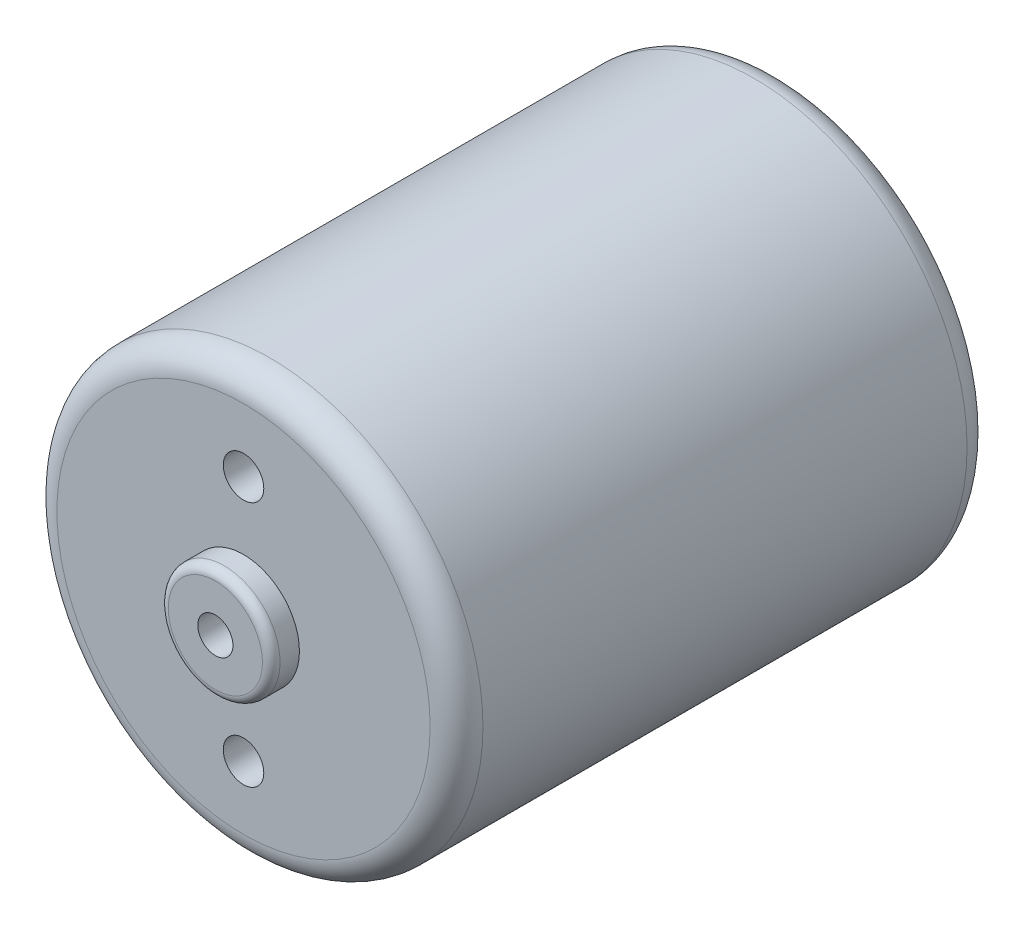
ISO-10303-21;
HEADER;
FILE_DESCRIPTION(('STEP AP214'),'2;1');
FILE_NAME('part.step','',(''),(''),'','','');
FILE_SCHEMA(('AUTOMOTIVE_DESIGN { 1 0 10303 214 1 1 1 1 }'));
ENDSEC;
DATA;
#1=APPLICATION_CONTEXT('core data for automotive mechanical design processes');
#2=APPLICATION_PROTOCOL_DEFINITION('international standard','automotive_design',2000,#1);
#3=PRODUCT_CONTEXT('',#1,'mechanical');
#4=PRODUCT('Part','Part','',(#3));
#5=PRODUCT_RELATED_PRODUCT_CATEGORY('part','',(#4));
#6=PRODUCT_DEFINITION_FORMATION('','',#4);
#7=PRODUCT_DEFINITION_CONTEXT('part definition',#1,'design');
#8=PRODUCT_DEFINITION('design','',#6,#7);
#9=PRODUCT_DEFINITION_SHAPE('','',#8);
#10=(LENGTH_UNIT() NAMED_UNIT(*) SI_UNIT(.MILLI.,.METRE.));
#11=(NAMED_UNIT(*) PLANE_ANGLE_UNIT() SI_UNIT($,.RADIAN.));
#12=(NAMED_UNIT(*) SI_UNIT($,.STERADIAN.) SOLID_ANGLE_UNIT());
#13=UNCERTAINTY_MEASURE_WITH_UNIT(LENGTH_MEASURE(1.E-05),#10,'distance_accuracy_value','');
#14=(GEOMETRIC_REPRESENTATION_CONTEXT(3) GLOBAL_UNCERTAINTY_ASSIGNED_CONTEXT((#13)) GLOBAL_UNIT_ASSIGNED_CONTEXT((#10,
#11,#12)) REPRESENTATION_CONTEXT('',''));
#15=CARTESIAN_POINT('',(0.,0.,0.));
#16=DIRECTION('',(0.,0.,1.));
#17=DIRECTION('',(1.,0.,0.));
#18=AXIS2_PLACEMENT_3D('',#15,#16,#17);
#19=CARTESIAN_POINT('',(0.,0.,-15.25));
#20=DIRECTION('',(0.,0.,1.));
#21=DIRECTION('',(1.,0.,0.));
#22=AXIS2_PLACEMENT_3D('',#19,#20,#21);
#23=PLANE('',#22);
#24=CARTESIAN_POINT('',(6.45,0.,-15.25));
#25=DIRECTION('',(0.,0.,-1.));
#26=DIRECTION('',(-1.,0.,0.));
#27=AXIS2_PLACEMENT_3D('',#24,#25,#26);
#28=CIRCLE('',#27,1.);
#29=CARTESIAN_POINT('',(5.45,0.,-15.25));
#30=VERTEX_POINT('',#29);
#31=EDGE_CURVE('E403',#30,#30,#28,.T.);
#32=ORIENTED_EDGE('',*,*,#31,.F.);
#33=EDGE_LOOP('',(#32));
#34=FACE_BOUND('',#33,.T.);
#35=CARTESIAN_POINT('',(-6.45,0.,-15.25));
#36=DIRECTION('',(0.,0.,-1.));
#37=DIRECTION('',(-1.,0.,0.));
#38=AXIS2_PLACEMENT_3D('',#35,#36,#37);
#39=CIRCLE('',#38,1.);
#40=CARTESIAN_POINT('',(-7.45,0.,-15.25));
#41=VERTEX_POINT('',#40);
#42=EDGE_CURVE('E410',#41,#41,#39,.T.);
#43=ORIENTED_EDGE('',*,*,#42,.F.);
#44=EDGE_LOOP('',(#43));
#45=FACE_BOUND('',#44,.T.);
#46=CARTESIAN_POINT('',(0.,0.,-15.25));
#47=DIRECTION('',(0.,0.,1.));
#48=DIRECTION('',(1.,0.,0.));
#49=AXIS2_PLACEMENT_3D('',#46,#47,#48);
#50=CIRCLE('',#49,10.6);
#51=CARTESIAN_POINT('',(10.6,0.,-15.25));
#52=VERTEX_POINT('',#51);
#53=EDGE_CURVE('E108',#52,#52,#50,.F.);
#54=ORIENTED_EDGE('',*,*,#53,.T.);
#55=EDGE_LOOP('',(#54));
#56=FACE_BOUND('',#55,.T.);
#57=CARTESIAN_POINT('',(0.,0.,-15.25));
#58=DIRECTION('',(0.,0.,-1.));
#59=DIRECTION('',(-1.,0.,0.));
#60=AXIS2_PLACEMENT_3D('',#57,#58,#59);
#61=CIRCLE('',#60,4.25);
#62=CARTESIAN_POINT('',(-3.75,2.,-15.25));
#63=VERTEX_POINT('',#62);
#64=CARTESIAN_POINT('',(-3.75,-2.,-15.25));
#65=VERTEX_POINT('',#64);
#66=EDGE_CURVE('E77',#63,#65,#61,.T.);
#67=ORIENTED_EDGE('',*,*,#66,.F.);
#68=DIRECTION('',(0.,1.,0.));
#69=VECTOR('',#68,1.);
#70=CARTESIAN_POINT('',(-3.75,2.,-15.25));
#71=LINE('',#70,#69);
#72=EDGE_CURVE('E82',#65,#63,#71,.T.);
#73=ORIENTED_EDGE('',*,*,#72,.F.);
#74=EDGE_LOOP('',(#67,#73));
#75=FACE_BOUND('',#74,.T.);
#76=ADVANCED_FACE('F43',(#34,#45,#56,#75),#23,.F.);
#77=CARTESIAN_POINT('',(0.,0.,15.25));
#78=DIRECTION('',(0.,0.,-1.));
#79=DIRECTION('',(-1.,0.,0.));
#80=AXIS2_PLACEMENT_3D('',#77,#78,#79);
#81=CYLINDRICAL_SURFACE('',#80,12.1);
#82=CARTESIAN_POINT('',(0.,0.,-13.75));
#83=DIRECTION('',(0.,0.,1.));
#84=DIRECTION('',(1.,0.,0.));
#85=AXIS2_PLACEMENT_3D('',#82,#83,#84);
#86=CIRCLE('',#85,12.1);
#87=CARTESIAN_POINT('',(-12.1,0.,-13.75));
#88=VERTEX_POINT('',#87);
#89=EDGE_CURVE('E104',#88,#88,#86,.T.);
#90=CARTESIAN_POINT('',(0.,0.,13.75));
#91=DIRECTION('',(0.,0.,1.));
#92=DIRECTION('',(1.,0.,0.));
#93=AXIS2_PLACEMENT_3D('',#90,#91,#92);
#94=CIRCLE('',#93,12.1);
#95=CARTESIAN_POINT('',(-12.1,0.,13.75));
#96=VERTEX_POINT('',#95);
#97=EDGE_CURVE('E100',#96,#96,#94,.F.);
#98=CARTESIAN_POINT('',(-12.1,0.,-13.75));
#99=CARTESIAN_POINT('',(-12.1,0.,-13.4635416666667));
#100=CARTESIAN_POINT('',(-12.1,0.,-13.1770833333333));
#101=CARTESIAN_POINT('',(-12.1,0.,-12.6041666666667));
#102=CARTESIAN_POINT('',(-12.1,0.,-12.3177083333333));
#103=CARTESIAN_POINT('',(-12.1,0.,-11.7447916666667));
#104=CARTESIAN_POINT('',(-12.1,0.,-11.4583333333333));
#105=CARTESIAN_POINT('',(-12.1,0.,-10.8854166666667));
#106=CARTESIAN_POINT('',(-12.1,0.,-10.5989583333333));
#107=CARTESIAN_POINT('',(-12.1,0.,-10.0260416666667));
#108=CARTESIAN_POINT('',(-12.1,0.,-9.73958333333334));
#109=CARTESIAN_POINT('',(-12.1,0.,-9.16666666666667));
#110=CARTESIAN_POINT('',(-12.1,0.,-8.88020833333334));
#111=CARTESIAN_POINT('',(-12.1,0.,-8.30729166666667));
#112=CARTESIAN_POINT('',(-12.1,0.,-8.02083333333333));
#113=CARTESIAN_POINT('',(-12.1,0.,-7.44791666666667));
#114=CARTESIAN_POINT('',(-12.1,0.,-7.16145833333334));
#115=CARTESIAN_POINT('',(-12.1,0.,-6.58854166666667));
#116=CARTESIAN_POINT('',(-12.1,0.,-6.30208333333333));
#117=CARTESIAN_POINT('',(-12.1,0.,-5.72916666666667));
#118=CARTESIAN_POINT('',(-12.1,0.,-5.44270833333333));
#119=CARTESIAN_POINT('',(-12.1,0.,-4.86979166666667));
#120=CARTESIAN_POINT('',(-12.1,0.,-4.58333333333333));
#121=CARTESIAN_POINT('',(-12.1,0.,-4.01041666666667));
#122=CARTESIAN_POINT('',(-12.1,0.,-3.72395833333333));
#123=CARTESIAN_POINT('',(-12.1,0.,-3.15104166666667));
#124=CARTESIAN_POINT('',(-12.1,0.,-2.86458333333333));
#125=CARTESIAN_POINT('',(-12.1,0.,-2.29166666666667));
#126=CARTESIAN_POINT('',(-12.1,0.,-2.00520833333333));
#127=CARTESIAN_POINT('',(-12.1,0.,-1.43229166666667));
#128=CARTESIAN_POINT('',(-12.1,0.,-1.14583333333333));
#129=CARTESIAN_POINT('',(-12.1,0.,-0.572916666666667));
#130=CARTESIAN_POINT('',(-12.1,0.,-0.286458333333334));
#131=CARTESIAN_POINT('',(-12.1,0.,0.286458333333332));
#132=CARTESIAN_POINT('',(-12.1,0.,0.572916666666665));
#133=CARTESIAN_POINT('',(-12.1,0.,1.14583333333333));
#134=CARTESIAN_POINT('',(-12.1,0.,1.43229166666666));
#135=CARTESIAN_POINT('',(-12.1,0.,2.00520833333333));
#136=CARTESIAN_POINT('',(-12.1,0.,2.29166666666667));
#137=CARTESIAN_POINT('',(-12.1,0.,2.86458333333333));
#138=CARTESIAN_POINT('',(-12.1,0.,3.15104166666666));
#139=CARTESIAN_POINT('',(-12.1,0.,3.72395833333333));
#140=CARTESIAN_POINT('',(-12.1,0.,4.01041666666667));
#141=CARTESIAN_POINT('',(-12.1,0.,4.58333333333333));
#142=CARTESIAN_POINT('',(-12.1,0.,4.86979166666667));
#143=CARTESIAN_POINT('',(-12.1,0.,5.44270833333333));
#144=CARTESIAN_POINT('',(-12.1,0.,5.72916666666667));
#145=CARTESIAN_POINT('',(-12.1,0.,6.30208333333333));
#146=CARTESIAN_POINT('',(-12.1,0.,6.58854166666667));
#147=CARTESIAN_POINT('',(-12.1,0.,7.16145833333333));
#148=CARTESIAN_POINT('',(-12.1,0.,7.44791666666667));
#149=CARTESIAN_POINT('',(-12.1,0.,8.02083333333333));
#150=CARTESIAN_POINT('',(-12.1,0.,8.30729166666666));
#151=CARTESIAN_POINT('',(-12.1,0.,8.88020833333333));
#152=CARTESIAN_POINT('',(-12.1,0.,9.16666666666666));
#153=CARTESIAN_POINT('',(-12.1,0.,9.73958333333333));
#154=CARTESIAN_POINT('',(-12.1,0.,10.0260416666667));
#155=CARTESIAN_POINT('',(-12.1,0.,10.5989583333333));
#156=CARTESIAN_POINT('',(-12.1,0.,10.8854166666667));
#157=CARTESIAN_POINT('',(-12.1,0.,11.4583333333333));
#158=CARTESIAN_POINT('',(-12.1,0.,11.7447916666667));
#159=CARTESIAN_POINT('',(-12.1,0.,12.3177083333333));
#160=CARTESIAN_POINT('',(-12.1,0.,12.6041666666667));
#161=CARTESIAN_POINT('',(-12.1,0.,13.1770833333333));
#162=CARTESIAN_POINT('',(-12.1,0.,13.4635416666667));
#163=CARTESIAN_POINT('',(-12.1,0.,13.75));
#164=B_SPLINE_CURVE_WITH_KNOTS('',3,(#98,#99,#100,#101,#102,#103,#104,#105,#106,#107,#108,#109,
#110,#111,#112,#113,#114,#115,#116,#117,#118,#119,#120,#121,#122,#123,#124,#125,#126,#127,#128,
#129,#130,#131,#132,#133,#134,#135,#136,#137,#138,#139,#140,#141,#142,#143,#144,#145,#146,#147,
#148,#149,#150,#151,#152,#153,#154,#155,#156,#157,#158,#159,#160,#161,#162,#163),.UNSPECIFIED.,
.F.,.F.,(4,2,2,2,2,2,2,2,2,2,2,2,2,2,2,2,2,2,2,2,2,2,2,2,2,2,2,2,2,2,2,2,4),(0.,
0.859374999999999,1.71875,2.578125,3.4375,4.296875,5.15625,6.015625,6.875,7.734375,8.59375,
9.453125,10.3125,11.171875,12.03125,12.890625,13.75,14.609375,15.46875,16.328125,17.1875,
18.046875,18.90625,19.765625,20.625,21.484375,22.34375,23.203125,24.0625,24.921875,25.78125,
26.640625,27.5),.UNSPECIFIED.);
#165=EDGE_CURVE('BSEAM158',#88,#96,#164,.T.);
#166=ORIENTED_EDGE('',*,*,#89,.T.);
#167=ORIENTED_EDGE('',*,*,#97,.T.);
#168=ORIENTED_EDGE('',*,*,#165,.T.);
#169=ORIENTED_EDGE('',*,*,#165,.F.);
#170=EDGE_LOOP('',(#166,#168,#167,#169));
#171=FACE_BOUND('',#170,.T.);
#172=ADVANCED_FACE('F158',(#171),#81,.T.);
#173=CARTESIAN_POINT('',(0.,0.,15.25));
#174=DIRECTION('',(0.,0.,1.));
#175=DIRECTION('',(1.,0.,0.));
#176=AXIS2_PLACEMENT_3D('',#173,#174,#175);
#177=PLANE('',#176);
#178=CARTESIAN_POINT('',(0.,7.,15.25));
#179=DIRECTION('',(0.,0.,1.));
#180=DIRECTION('',(1.,0.,0.));
#181=AXIS2_PLACEMENT_3D('',#178,#179,#180);
#182=CIRCLE('',#181,1.15);
#183=CARTESIAN_POINT('',(1.15,7.,15.25));
#184=VERTEX_POINT('',#183);
#185=EDGE_CURVE('E426',#184,#184,#182,.T.);
#186=ORIENTED_EDGE('',*,*,#185,.F.);
#187=EDGE_LOOP('',(#186));
#188=FACE_BOUND('',#187,.T.);
#189=CARTESIAN_POINT('',(0.,-7.,15.25));
#190=DIRECTION('',(0.,0.,1.));
#191=DIRECTION('',(1.,0.,0.));
#192=AXIS2_PLACEMENT_3D('',#189,#190,#191);
#193=CIRCLE('',#192,1.15);
#194=CARTESIAN_POINT('',(1.15,-7.,15.25));
#195=VERTEX_POINT('',#194);
#196=EDGE_CURVE('E422',#195,#195,#193,.T.);
#197=ORIENTED_EDGE('',*,*,#196,.F.);
#198=EDGE_LOOP('',(#197));
#199=FACE_BOUND('',#198,.T.);
#200=CARTESIAN_POINT('',(0.,0.,15.25));
#201=DIRECTION('',(0.,0.,1.));
#202=DIRECTION('',(1.,0.,0.));
#203=AXIS2_PLACEMENT_3D('',#200,#201,#202);
#204=CIRCLE('',#203,3.175);
#205=CARTESIAN_POINT('',(3.175,0.,15.25));
#206=VERTEX_POINT('',#205);
#207=EDGE_CURVE('E96',#206,#206,#204,.T.);
#208=ORIENTED_EDGE('',*,*,#207,.F.);
#209=EDGE_LOOP('',(#208));
#210=FACE_BOUND('',#209,.T.);
#211=CARTESIAN_POINT('',(0.,0.,15.25));
#212=DIRECTION('',(0.,0.,1.));
#213=DIRECTION('',(1.,0.,0.));
#214=AXIS2_PLACEMENT_3D('',#211,#212,#213);
#215=CIRCLE('',#214,10.6);
#216=CARTESIAN_POINT('',(10.6,0.,15.25));
#217=VERTEX_POINT('',#216);
#218=EDGE_CURVE('E112',#217,#217,#215,.T.);
#219=ORIENTED_EDGE('',*,*,#218,.T.);
#220=EDGE_LOOP('',(#219));
#221=FACE_BOUND('',#220,.T.);
#222=ADVANCED_FACE('F154',(#188,#199,#210,#221),#177,.T.);
#223=CARTESIAN_POINT('',(0.,0.,-13.75));
#224=DIRECTION('',(0.,0.,1.));
#225=DIRECTION('',(1.,0.,0.));
#226=AXIS2_PLACEMENT_3D('',#223,#224,#225);
#227=TOROIDAL_SURFACE('',#226,10.6,1.5);
#228=ORIENTED_EDGE('',*,*,#53,.F.);
#229=EDGE_LOOP('',(#228));
#230=FACE_BOUND('',#229,.T.);
#231=ORIENTED_EDGE('',*,*,#89,.F.);
#232=EDGE_LOOP('',(#231));
#233=FACE_BOUND('',#232,.T.);
#234=ADVANCED_FACE('F157',(#230,#233),#227,.T.);
#235=CARTESIAN_POINT('',(0.,0.,13.75));
#236=DIRECTION('',(0.,0.,1.));
#237=DIRECTION('',(1.,0.,0.));
#238=AXIS2_PLACEMENT_3D('',#235,#236,#237);
#239=TOROIDAL_SURFACE('',#238,10.6,1.5);
#240=ORIENTED_EDGE('',*,*,#97,.F.);
#241=EDGE_LOOP('',(#240));
#242=FACE_BOUND('',#241,.T.);
#243=ORIENTED_EDGE('',*,*,#218,.F.);
#244=EDGE_LOOP('',(#243));
#245=FACE_BOUND('',#244,.T.);
#246=ADVANCED_FACE('F152',(#242,#245),#239,.T.);
#247=CARTESIAN_POINT('',(0.,0.,16.85));
#248=DIRECTION('',(0.,0.,-1.));
#249=DIRECTION('',(-1.,0.,0.));
#250=AXIS2_PLACEMENT_3D('',#247,#248,#249);
#251=CYLINDRICAL_SURFACE('',#250,3.175);
#252=CARTESIAN_POINT('',(0.,0.,16.35));
#253=DIRECTION('',(0.,0.,1.));
#254=DIRECTION('',(1.,0.,0.));
#255=AXIS2_PLACEMENT_3D('',#252,#253,#254);
#256=CIRCLE('',#255,3.175);
#257=CARTESIAN_POINT('',(3.175,0.,16.35));
#258=VERTEX_POINT('',#257);
#259=EDGE_CURVE('E11',#258,#258,#256,.F.);
#260=ORIENTED_EDGE('',*,*,#259,.T.);
#261=EDGE_LOOP('',(#260));
#262=FACE_BOUND('',#261,.T.);
#263=ORIENTED_EDGE('',*,*,#207,.T.);
#264=EDGE_LOOP('',(#263));
#265=FACE_BOUND('',#264,.T.);
#266=ADVANCED_FACE('F148',(#262,#265),#251,.T.);
#267=CARTESIAN_POINT('',(0.,0.,16.85));
#268=DIRECTION('',(0.,0.,1.));
#269=DIRECTION('',(1.,0.,0.));
#270=AXIS2_PLACEMENT_3D('',#267,#268,#269);
#271=PLANE('',#270);
#272=CARTESIAN_POINT('',(0.,0.,16.85));
#273=DIRECTION('',(0.,0.,1.));
#274=DIRECTION('',(1.,0.,0.));
#275=AXIS2_PLACEMENT_3D('',#272,#273,#274);
#276=CIRCLE('',#275,2.675);
#277=CARTESIAN_POINT('',(2.675,0.,16.85));
#278=VERTEX_POINT('',#277);
#279=EDGE_CURVE('E52',#278,#278,#276,.T.);
#280=ORIENTED_EDGE('',*,*,#279,.T.);
#281=EDGE_LOOP('',(#280));
#282=FACE_BOUND('',#281,.T.);
#283=CARTESIAN_POINT('',(0.,0.,16.85));
#284=DIRECTION('',(0.,0.,1.));
#285=DIRECTION('',(1.,0.,0.));
#286=AXIS2_PLACEMENT_3D('',#283,#284,#285);
#287=CIRCLE('',#286,1.);
#288=CARTESIAN_POINT('',(1.,0.,16.85));
#289=VERTEX_POINT('',#288);
#290=EDGE_CURVE('E394',#289,#289,#287,.T.);
#291=ORIENTED_EDGE('',*,*,#290,.F.);
#292=EDGE_LOOP('',(#291));
#293=FACE_BOUND('',#292,.T.);
#294=ADVANCED_FACE('F145',(#282,#293),#271,.T.);
#295=CARTESIAN_POINT('',(0.,0.,-17.25));
#296=DIRECTION('',(0.,0.,1.));
#297=DIRECTION('',(1.,0.,0.));
#298=AXIS2_PLACEMENT_3D('',#295,#296,#297);
#299=CYLINDRICAL_SURFACE('',#298,4.25);
#300=DIRECTION('',(0.,0.,1.));
#301=VECTOR('',#300,1.);
#302=CARTESIAN_POINT('',(-3.75,-2.,-17.25));
#303=LINE('',#302,#301);
#304=CARTESIAN_POINT('',(-3.75,-2.,-16.75));
#305=VERTEX_POINT('',#304);
#306=EDGE_CURVE('E81',#305,#65,#303,.T.);
#307=ORIENTED_EDGE('',*,*,#306,.F.);
#308=CARTESIAN_POINT('',(0.,0.,-16.75));
#309=DIRECTION('',(0.,0.,-1.));
#310=DIRECTION('',(-1.,0.,0.));
#311=AXIS2_PLACEMENT_3D('',#308,#309,#310);
#312=CIRCLE('',#311,4.25);
#313=CARTESIAN_POINT('',(-3.75,2.,-16.75));
#314=VERTEX_POINT('',#313);
#315=EDGE_CURVE('E66',#305,#314,#312,.F.);
#316=ORIENTED_EDGE('',*,*,#315,.T.);
#317=DIRECTION('',(0.,0.,1.));
#318=VECTOR('',#317,1.);
#319=CARTESIAN_POINT('',(-3.75,2.,-17.25));
#320=LINE('',#319,#318);
#321=EDGE_CURVE('E74',#314,#63,#320,.T.);
#322=ORIENTED_EDGE('',*,*,#321,.T.);
#323=ORIENTED_EDGE('',*,*,#66,.T.);
#324=EDGE_LOOP('',(#307,#316,#322,#323));
#325=FACE_BOUND('',#324,.T.);
#326=ADVANCED_FACE('F76',(#325),#299,.T.);
#327=CARTESIAN_POINT('',(-3.75,2.,-17.25));
#328=DIRECTION('',(1.,0.,0.));
#329=DIRECTION('',(0.,0.,-1.));
#330=AXIS2_PLACEMENT_3D('',#327,#328,#329);
#331=PLANE('',#330);
#332=CARTESIAN_POINT('',(-3.75,2.,-16.75));
#333=CARTESIAN_POINT('',(-3.75,2.00003471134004,-16.7642078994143));
#334=CARTESIAN_POINT('',(-3.75,1.99871520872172,-16.7783774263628));
#335=CARTESIAN_POINT('',(-3.75,1.99367316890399,-16.8061557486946));
#336=CARTESIAN_POINT('',(-3.75,1.98997251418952,-16.819768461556));
#337=CARTESIAN_POINT('',(-3.75,1.9804782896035,-16.8461792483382));
#338=CARTESIAN_POINT('',(-3.75,1.97469112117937,-16.8589796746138));
#339=CARTESIAN_POINT('',(-3.75,1.9613984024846,-16.8836771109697));
#340=CARTESIAN_POINT('',(-3.75,1.95388868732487,-16.8955718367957));
#341=CARTESIAN_POINT('',(-3.75,1.93179249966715,-16.9263501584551));
#342=CARTESIAN_POINT('',(-3.75,1.91592632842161,-16.9443136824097));
#343=CARTESIAN_POINT('',(-3.75,1.88164328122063,-16.9775992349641));
#344=CARTESIAN_POINT('',(-3.75,1.86321950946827,-16.9929138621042));
#345=CARTESIAN_POINT('',(-3.75,1.8096498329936,-17.0323581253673));
#346=CARTESIAN_POINT('',(-3.75,1.77269791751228,-17.0540106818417));
#347=CARTESIAN_POINT('',(-3.75,1.69620167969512,-17.0919521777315));
#348=CARTESIAN_POINT('',(-3.75,1.65665140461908,-17.1082282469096));
#349=CARTESIAN_POINT('',(-3.75,1.55780019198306,-17.1432738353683));
#350=CARTESIAN_POINT('',(-3.75,1.49771601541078,-17.1597966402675));
#351=CARTESIAN_POINT('',(-3.75,1.37621733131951,-17.1870857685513));
#352=CARTESIAN_POINT('',(-3.75,1.31480002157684,-17.1978384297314));
#353=CARTESIAN_POINT('',(-3.75,1.19086880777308,-17.2153718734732));
#354=CARTESIAN_POINT('',(-3.75,1.12835000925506,-17.2221166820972));
#355=CARTESIAN_POINT('',(-3.75,1.0031513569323,-17.2327590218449));
#356=CARTESIAN_POINT('',(-3.75,0.9404717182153,-17.2366593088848));
#357=CARTESIAN_POINT('',(-3.75,0.803729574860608,-17.2431121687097));
#358=CARTESIAN_POINT('',(-3.75,0.729651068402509,-17.2452952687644));
#359=CARTESIAN_POINT('',(-3.75,0.581444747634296,-17.2482157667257));
#360=CARTESIAN_POINT('',(-3.75,0.507316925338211,-17.2489526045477));
#361=CARTESIAN_POINT('',(-3.75,0.36096870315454,-17.2497919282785));
#362=CARTESIAN_POINT('',(-3.75,0.288748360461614,-17.2499102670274));
#363=CARTESIAN_POINT('',(-3.75,0.180440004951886,-17.249986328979));
#364=CARTESIAN_POINT('',(-3.75,0.144351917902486,-17.2499947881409));
#365=CARTESIAN_POINT('',(-3.75,0.0721758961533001,-17.2500003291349));
#366=CARTESIAN_POINT('',(-3.75,0.0360879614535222,-17.2499974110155));
#367=CARTESIAN_POINT('',(-3.75,0.,-17.25));
#368=B_SPLINE_CURVE_WITH_KNOTS('',3,(#332,#333,#334,#335,#336,#337,#338,#339,#340,#341,#342,
#343,#344,#345,#346,#347,#348,#349,#350,#351,#352,#353,#354,#355,#356,#357,#358,#359,#360,#361,
#362,#363,#364,#365,#366,#367),.UNSPECIFIED.,.F.,.F.,(4,2,2,2,2,2,2,2,2,2,2,2,2,2,2,2,2,4),(0.,
0.0425015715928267,0.0846180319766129,0.126606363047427,0.168697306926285,0.240181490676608,
0.311862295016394,0.439621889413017,0.567685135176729,0.754138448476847,0.941031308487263,
1.12957730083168,1.31794037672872,1.5402440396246,1.76263377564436,1.97929442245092,
2.08755871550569,2.19582254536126),.UNSPECIFIED.);
#369=CARTESIAN_POINT('',(-3.75,0.,-17.25));
#370=VERTEX_POINT('',#369);
#371=EDGE_CURVE('E120',#314,#370,#368,.T.);
#372=ORIENTED_EDGE('',*,*,#371,.T.);
#373=CARTESIAN_POINT('',(-3.75,0.,-17.25));
#374=CARTESIAN_POINT('',(-3.75,-0.0416614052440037,-17.2499954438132));
#375=CARTESIAN_POINT('',(-3.75,-0.0833227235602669,-17.2500006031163));
#376=CARTESIAN_POINT('',(-3.75,-0.166645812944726,-17.2499907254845));
#377=CARTESIAN_POINT('',(-3.75,-0.20830758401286,-17.2499756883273));
#378=CARTESIAN_POINT('',(-3.75,-0.333377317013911,-17.2498407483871));
#379=CARTESIAN_POINT('',(-3.75,-0.416785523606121,-17.2496308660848));
#380=CARTESIAN_POINT('',(-3.75,-0.583564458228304,-17.2481609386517));
#381=CARTESIAN_POINT('',(-3.75,-0.666935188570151,-17.246901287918));
#382=CARTESIAN_POINT('',(-3.75,-0.83358395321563,-17.2419914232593));
#383=CARTESIAN_POINT('',(-3.75,-0.916862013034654,-17.238342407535));
#384=CARTESIAN_POINT('',(-3.75,-1.05690551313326,-17.228538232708));
#385=CARTESIAN_POINT('',(-3.75,-1.11374540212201,-17.2235371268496));
#386=CARTESIAN_POINT('',(-3.75,-1.2272418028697,-17.2106214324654));
#387=CARTESIAN_POINT('',(-3.75,-1.28389750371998,-17.202699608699));
#388=CARTESIAN_POINT('',(-3.75,-1.40569946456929,-17.1812084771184));
#389=CARTESIAN_POINT('',(-3.75,-1.47073476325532,-17.1669323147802));
#390=CARTESIAN_POINT('',(-3.75,-1.56644189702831,-17.1394673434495));
#391=CARTESIAN_POINT('',(-3.75,-1.59798295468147,-17.1293269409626));
#392=CARTESIAN_POINT('',(-3.75,-1.66013634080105,-17.1065428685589));
#393=CARTESIAN_POINT('',(-3.75,-1.690749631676,-17.093901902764));
#394=CARTESIAN_POINT('',(-3.75,-1.74245715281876,-17.0693141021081));
#395=CARTESIAN_POINT('',(-3.75,-1.76389553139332,-17.0580963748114));
#396=CARTESIAN_POINT('',(-3.75,-1.80565641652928,-17.0336498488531));
#397=CARTESIAN_POINT('',(-3.75,-1.82597730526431,-17.0204182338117));
#398=CARTESIAN_POINT('',(-3.75,-1.86508632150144,-16.9914500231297));
#399=CARTESIAN_POINT('',(-3.75,-1.88385764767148,-16.9756903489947));
#400=CARTESIAN_POINT('',(-3.75,-1.91866765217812,-16.9413757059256));
#401=CARTESIAN_POINT('',(-3.75,-1.93471342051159,-16.9228282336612));
#402=CARTESIAN_POINT('',(-3.75,-1.9573255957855,-16.8903414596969));
#403=CARTESIAN_POINT('',(-3.75,-1.96518392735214,-16.8773053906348));
#404=CARTESIAN_POINT('',(-3.75,-1.97878760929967,-16.8501954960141));
#405=CARTESIAN_POINT('',(-3.75,-1.98453918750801,-16.8361248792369));
#406=CARTESIAN_POINT('',(-3.75,-1.9925767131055,-16.8101064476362));
#407=CARTESIAN_POINT('',(-3.75,-1.9953276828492,-16.798302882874));
#408=CARTESIAN_POINT('',(-3.75,-1.99905488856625,-16.7743411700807));
#409=CARTESIAN_POINT('',(-3.75,-2.00001919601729,-16.762181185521));
#410=CARTESIAN_POINT('',(-3.75,-2.,-16.75));
#411=B_SPLINE_CURVE_WITH_KNOTS('',3,(#373,#374,#375,#376,#377,#378,#379,#380,#381,#382,#383,
#384,#385,#386,#387,#388,#389,#390,#391,#392,#393,#394,#395,#396,#397,#398,#399,#400,#401,#402,
#403,#404,#405,#406,#407,#408,#409,#410),.UNSPECIFIED.,.F.,.F.,(4,2,2,2,2,2,2,2,2,2,2,2,2,2,2,2,
2,2,4),(0.,0.124984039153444,0.249969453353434,0.500192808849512,0.750322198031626,
1.00032625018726,1.17144668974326,1.3429939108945,1.54232412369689,1.64164162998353,
1.74085231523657,1.813357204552,1.88596443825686,1.95927677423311,2.0323953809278,
2.0779141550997,2.1232972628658,2.15952677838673,2.19599731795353),.UNSPECIFIED.);
#412=EDGE_CURVE('E59',#370,#305,#411,.T.);
#413=ORIENTED_EDGE('',*,*,#412,.T.);
#414=ORIENTED_EDGE('',*,*,#306,.T.);
#415=ORIENTED_EDGE('',*,*,#72,.T.);
#416=ORIENTED_EDGE('',*,*,#321,.F.);
#417=EDGE_LOOP('',(#372,#413,#414,#415,#416));
#418=FACE_BOUND('',#417,.T.);
#419=ADVANCED_FACE('F89',(#418),#331,.F.);
#420=CARTESIAN_POINT('',(0.,0.,-17.25));
#421=DIRECTION('',(0.,0.,-1.));
#422=DIRECTION('',(-1.,0.,0.));
#423=AXIS2_PLACEMENT_3D('',#420,#421,#422);
#424=PLANE('',#423);
#425=CARTESIAN_POINT('',(0.,0.,-17.25));
#426=DIRECTION('',(0.,0.,-1.));
#427=DIRECTION('',(-1.,0.,0.));
#428=AXIS2_PLACEMENT_3D('',#425,#426,#427);
#429=CIRCLE('',#428,3.75);
#430=EDGE_CURVE('E116',#370,#370,#429,.T.);
#431=ORIENTED_EDGE('',*,*,#430,.T.);
#432=EDGE_LOOP('',(#431));
#433=FACE_BOUND('',#432,.T.);
#434=CARTESIAN_POINT('',(0.,0.,-17.25));
#435=DIRECTION('',(0.,0.,1.));
#436=DIRECTION('',(1.,0.,0.));
#437=AXIS2_PLACEMENT_3D('',#434,#435,#436);
#438=CIRCLE('',#437,1.);
#439=CARTESIAN_POINT('',(1.,0.,-17.25));
#440=VERTEX_POINT('',#439);
#441=EDGE_CURVE('E87',#440,#440,#438,.T.);
#442=ORIENTED_EDGE('',*,*,#441,.T.);
#443=EDGE_LOOP('',(#442));
#444=FACE_BOUND('',#443,.T.);
#445=ADVANCED_FACE('F140',(#433,#444),#424,.T.);
#446=CARTESIAN_POINT('',(0.,0.,-17.25));
#447=DIRECTION('',(0.,0.,1.));
#448=DIRECTION('',(1.,0.,0.));
#449=AXIS2_PLACEMENT_3D('',#446,#447,#448);
#450=CYLINDRICAL_SURFACE('',#449,1.);
#451=ORIENTED_EDGE('',*,*,#441,.F.);
#452=EDGE_LOOP('',(#451));
#453=FACE_BOUND('',#452,.T.);
#454=ORIENTED_EDGE('',*,*,#290,.T.);
#455=EDGE_LOOP('',(#454));
#456=FACE_BOUND('',#455,.T.);
#457=ADVANCED_FACE('F203',(#453,#456),#450,.F.);
#458=CARTESIAN_POINT('',(-6.45,0.,-5.25));
#459=DIRECTION('',(0.,0.,-1.));
#460=DIRECTION('',(-1.,0.,0.));
#461=AXIS2_PLACEMENT_3D('',#458,#459,#460);
#462=CYLINDRICAL_SURFACE('',#461,1.);
#463=CARTESIAN_POINT('',(-6.45,0.,-5.25));
#464=DIRECTION('',(0.,0.,-1.));
#465=DIRECTION('',(-1.,0.,0.));
#466=AXIS2_PLACEMENT_3D('',#463,#464,#465);
#467=CIRCLE('',#466,1.);
#468=CARTESIAN_POINT('',(-7.45,0.,-5.25));
#469=VERTEX_POINT('',#468);
#470=EDGE_CURVE('E406',#469,#469,#467,.T.);
#471=ORIENTED_EDGE('',*,*,#470,.F.);
#472=EDGE_LOOP('',(#471));
#473=FACE_BOUND('',#472,.T.);
#474=ORIENTED_EDGE('',*,*,#42,.T.);
#475=EDGE_LOOP('',(#474));
#476=FACE_BOUND('',#475,.T.);
#477=ADVANCED_FACE('F210',(#473,#476),#462,.F.);
#478=CARTESIAN_POINT('',(-6.45,0.,-5.25));
#479=DIRECTION('',(0.,0.,-1.));
#480=DIRECTION('',(-1.,0.,0.));
#481=AXIS2_PLACEMENT_3D('',#478,#479,#480);
#482=PLANE('',#481);
#483=ORIENTED_EDGE('',*,*,#470,.T.);
#484=EDGE_LOOP('',(#483));
#485=FACE_BOUND('',#484,.T.);
#486=ADVANCED_FACE('F218',(#485),#482,.T.);
#487=CARTESIAN_POINT('',(6.45,0.,-5.25));
#488=DIRECTION('',(0.,0.,-1.));
#489=DIRECTION('',(-1.,0.,0.));
#490=AXIS2_PLACEMENT_3D('',#487,#488,#489);
#491=CYLINDRICAL_SURFACE('',#490,1.);
#492=CARTESIAN_POINT('',(6.45,0.,-5.25));
#493=DIRECTION('',(0.,0.,-1.));
#494=DIRECTION('',(-1.,0.,0.));
#495=AXIS2_PLACEMENT_3D('',#492,#493,#494);
#496=CIRCLE('',#495,1.);
#497=CARTESIAN_POINT('',(5.45,0.,-5.25));
#498=VERTEX_POINT('',#497);
#499=EDGE_CURVE('E397',#498,#498,#496,.T.);
#500=ORIENTED_EDGE('',*,*,#499,.F.);
#501=EDGE_LOOP('',(#500));
#502=FACE_BOUND('',#501,.T.);
#503=ORIENTED_EDGE('',*,*,#31,.T.);
#504=EDGE_LOOP('',(#503));
#505=FACE_BOUND('',#504,.T.);
#506=ADVANCED_FACE('F226',(#502,#505),#491,.F.);
#507=CARTESIAN_POINT('',(6.45,0.,-5.25));
#508=DIRECTION('',(0.,0.,-1.));
#509=DIRECTION('',(-1.,0.,0.));
#510=AXIS2_PLACEMENT_3D('',#507,#508,#509);
#511=PLANE('',#510);
#512=ORIENTED_EDGE('',*,*,#499,.T.);
#513=EDGE_LOOP('',(#512));
#514=FACE_BOUND('',#513,.T.);
#515=ADVANCED_FACE('F234',(#514),#511,.T.);
#516=CARTESIAN_POINT('',(0.,-7.,10.25));
#517=DIRECTION('',(0.,0.,1.));
#518=DIRECTION('',(1.,0.,0.));
#519=AXIS2_PLACEMENT_3D('',#516,#517,#518);
#520=CYLINDRICAL_SURFACE('',#519,1.15);
#521=CARTESIAN_POINT('',(0.,-7.,10.25));
#522=DIRECTION('',(0.,0.,1.));
#523=DIRECTION('',(1.,0.,0.));
#524=AXIS2_PLACEMENT_3D('',#521,#522,#523);
#525=CIRCLE('',#524,1.15);
#526=CARTESIAN_POINT('',(1.15,-7.,10.25));
#527=VERTEX_POINT('',#526);
#528=EDGE_CURVE('E418',#527,#527,#525,.T.);
#529=ORIENTED_EDGE('',*,*,#528,.F.);
#530=EDGE_LOOP('',(#529));
#531=FACE_BOUND('',#530,.T.);
#532=ORIENTED_EDGE('',*,*,#196,.T.);
#533=EDGE_LOOP('',(#532));
#534=FACE_BOUND('',#533,.T.);
#535=ADVANCED_FACE('F242',(#531,#534),#520,.F.);
#536=CARTESIAN_POINT('',(0.,-7.,10.25));
#537=DIRECTION('',(0.,0.,1.));
#538=DIRECTION('',(1.,0.,0.));
#539=AXIS2_PLACEMENT_3D('',#536,#537,#538);
#540=PLANE('',#539);
#541=ORIENTED_EDGE('',*,*,#528,.T.);
#542=EDGE_LOOP('',(#541));
#543=FACE_BOUND('',#542,.T.);
#544=ADVANCED_FACE('F251',(#543),#540,.T.);
#545=CARTESIAN_POINT('',(0.,7.,10.25));
#546=DIRECTION('',(0.,0.,1.));
#547=DIRECTION('',(1.,0.,0.));
#548=AXIS2_PLACEMENT_3D('',#545,#546,#547);
#549=CYLINDRICAL_SURFACE('',#548,1.15);
#550=CARTESIAN_POINT('',(0.,7.,10.25));
#551=DIRECTION('',(0.,0.,1.));
#552=DIRECTION('',(1.,0.,0.));
#553=AXIS2_PLACEMENT_3D('',#550,#551,#552);
#554=CIRCLE('',#553,1.15);
#555=CARTESIAN_POINT('',(1.15,7.,10.25));
#556=VERTEX_POINT('',#555);
#557=EDGE_CURVE('E411',#556,#556,#554,.T.);
#558=ORIENTED_EDGE('',*,*,#557,.F.);
#559=EDGE_LOOP('',(#558));
#560=FACE_BOUND('',#559,.T.);
#561=ORIENTED_EDGE('',*,*,#185,.T.);
#562=EDGE_LOOP('',(#561));
#563=FACE_BOUND('',#562,.T.);
#564=ADVANCED_FACE('F259',(#560,#563),#549,.F.);
#565=CARTESIAN_POINT('',(0.,7.,10.25));
#566=DIRECTION('',(0.,0.,1.));
#567=DIRECTION('',(1.,0.,0.));
#568=AXIS2_PLACEMENT_3D('',#565,#566,#567);
#569=PLANE('',#568);
#570=ORIENTED_EDGE('',*,*,#557,.T.);
#571=EDGE_LOOP('',(#570));
#572=FACE_BOUND('',#571,.T.);
#573=ADVANCED_FACE('F267',(#572),#569,.T.);
#574=CARTESIAN_POINT('',(0.,0.,-16.75));
#575=DIRECTION('',(0.,0.,-1.));
#576=DIRECTION('',(-1.,0.,0.));
#577=AXIS2_PLACEMENT_3D('',#574,#575,#576);
#578=TOROIDAL_SURFACE('',#577,3.75,0.5);
#579=ORIENTED_EDGE('',*,*,#371,.F.);
#580=ORIENTED_EDGE('',*,*,#315,.F.);
#581=ORIENTED_EDGE('',*,*,#412,.F.);
#582=ORIENTED_EDGE('',*,*,#430,.F.);
#583=EDGE_LOOP('',(#579,#580,#581,#582));
#584=FACE_BOUND('',#583,.T.);
#585=ADVANCED_FACE('F133',(#584),#578,.T.);
#586=CARTESIAN_POINT('',(0.,0.,16.35));
#587=DIRECTION('',(0.,0.,1.));
#588=DIRECTION('',(1.,0.,0.));
#589=AXIS2_PLACEMENT_3D('',#586,#587,#588);
#590=TOROIDAL_SURFACE('',#589,2.675,0.5);
#591=ORIENTED_EDGE('',*,*,#259,.F.);
#592=EDGE_LOOP('',(#591));
#593=FACE_BOUND('',#592,.T.);
#594=ORIENTED_EDGE('',*,*,#279,.F.);
#595=EDGE_LOOP('',(#594));
#596=FACE_BOUND('',#595,.T.);
#597=ADVANCED_FACE('F45',(#593,#596),#590,.T.);
#598=CLOSED_SHELL('',(#76,#172,#222,#234,#246,#266,#294,#326,#419,#445,#457,#477,#486,#506,#515,
#535,#544,#564,#573,#585,#597));
#599=MANIFOLD_SOLID_BREP('B2',#598);
#600=ADVANCED_BREP_SHAPE_REPRESENTATION('',(#18,#599),#14);
#601=SHAPE_DEFINITION_REPRESENTATION(#9,#600);
ENDSEC;
END-ISO-10303-21;
